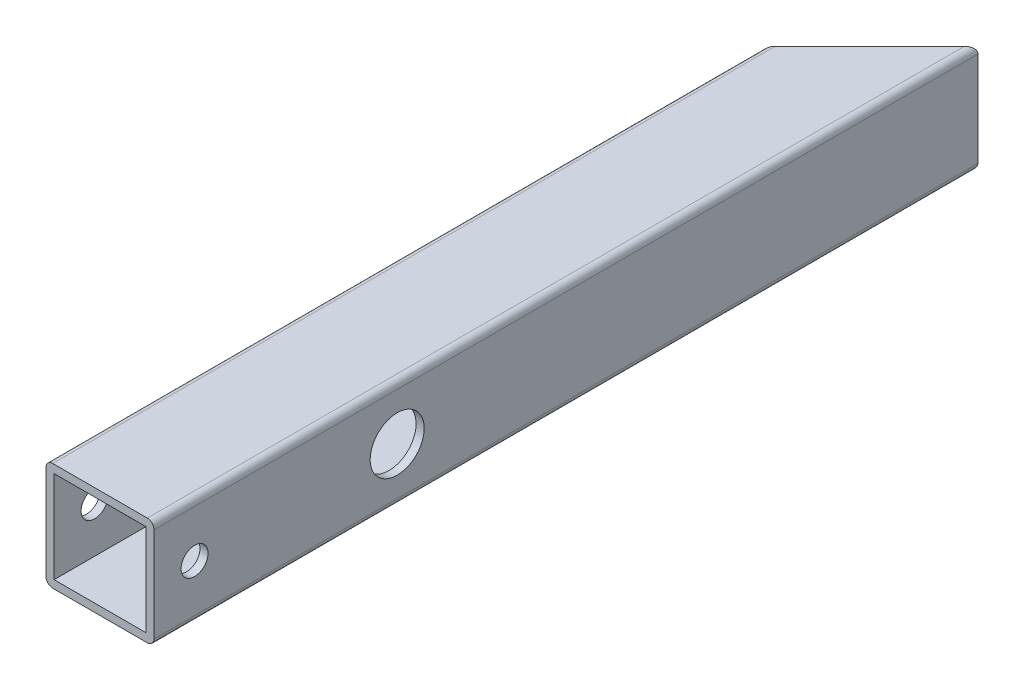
ISO-10303-21;
HEADER;
FILE_DESCRIPTION(('STEP AP214'),'2;1');
FILE_NAME('part.step','',(''),(''),'','','');
FILE_SCHEMA(('AUTOMOTIVE_DESIGN { 1 0 10303 214 1 1 1 1 }'));
ENDSEC;
DATA;
#1=APPLICATION_CONTEXT('core data for automotive mechanical design processes');
#2=APPLICATION_PROTOCOL_DEFINITION('international standard','automotive_design',2000,#1);
#3=PRODUCT_CONTEXT('',#1,'mechanical');
#4=PRODUCT('Part','Part','',(#3));
#5=PRODUCT_RELATED_PRODUCT_CATEGORY('part','',(#4));
#6=PRODUCT_DEFINITION_FORMATION('','',#4);
#7=PRODUCT_DEFINITION_CONTEXT('part definition',#1,'design');
#8=PRODUCT_DEFINITION('design','',#6,#7);
#9=PRODUCT_DEFINITION_SHAPE('','',#8);
#10=(LENGTH_UNIT() NAMED_UNIT(*) SI_UNIT(.MILLI.,.METRE.));
#11=(NAMED_UNIT(*) PLANE_ANGLE_UNIT() SI_UNIT($,.RADIAN.));
#12=(NAMED_UNIT(*) SI_UNIT($,.STERADIAN.) SOLID_ANGLE_UNIT());
#13=UNCERTAINTY_MEASURE_WITH_UNIT(LENGTH_MEASURE(1.E-05),#10,'distance_accuracy_value','');
#14=(GEOMETRIC_REPRESENTATION_CONTEXT(3) GLOBAL_UNCERTAINTY_ASSIGNED_CONTEXT((#13)) GLOBAL_UNIT_ASSIGNED_CONTEXT((#10,
#11,#12)) REPRESENTATION_CONTEXT('',''));
#15=CARTESIAN_POINT('',(0.,0.,0.));
#16=DIRECTION('',(0.,0.,1.));
#17=DIRECTION('',(1.,0.,0.));
#18=AXIS2_PLACEMENT_3D('',#15,#16,#17);
#19=CARTESIAN_POINT('',(1.11022302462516E-13,-80.0000000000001,610.));
#20=DIRECTION('',(0.,0.,1.));
#21=DIRECTION('',(0.999999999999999,0.,0.));
#22=AXIS2_PLACEMENT_3D('',#19,#20,#21);
#23=PLANE('',#22);
#24=DIRECTION('',(0.,-1.,0.));
#25=VECTOR('',#24,1.);
#26=CARTESIAN_POINT('',(0.,0.,610.));
#27=LINE('',#26,#25);
#28=CARTESIAN_POINT('',(0.,-4.99999999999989,610.));
#29=VERTEX_POINT('',#28);
#30=CARTESIAN_POINT('',(1.11022302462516E-13,-74.9999999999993,610.));
#31=VERTEX_POINT('',#30);
#32=EDGE_CURVE('E197',#29,#31,#27,.T.);
#33=ORIENTED_EDGE('',*,*,#32,.T.);
#34=CARTESIAN_POINT('',(5.00000000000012,-74.9999999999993,610.));
#35=DIRECTION('',(0.,0.,1.));
#36=DIRECTION('',(0.999999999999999,0.,0.));
#37=AXIS2_PLACEMENT_3D('',#34,#35,#36);
#38=CIRCLE('',#37,5.);
#39=CARTESIAN_POINT('',(5.00000000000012,-80.0000000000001,610.));
#40=VERTEX_POINT('',#39);
#41=EDGE_CURVE('E238',#31,#40,#38,.T.);
#42=ORIENTED_EDGE('',*,*,#41,.T.);
#43=DIRECTION('',(0.999999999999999,0.,0.));
#44=VECTOR('',#43,1.);
#45=CARTESIAN_POINT('',(1.11022302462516E-13,-80.0000000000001,610.));
#46=LINE('',#45,#44);
#47=CARTESIAN_POINT('',(74.9999999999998,-80.0000000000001,610.));
#48=VERTEX_POINT('',#47);
#49=EDGE_CURVE('E200',#40,#48,#46,.T.);
#50=ORIENTED_EDGE('',*,*,#49,.T.);
#51=CARTESIAN_POINT('',(74.9999999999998,-74.9999999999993,610.));
#52=DIRECTION('',(0.,0.,1.));
#53=DIRECTION('',(0.999999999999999,0.,0.));
#54=AXIS2_PLACEMENT_3D('',#51,#52,#53);
#55=CIRCLE('',#54,5.);
#56=CARTESIAN_POINT('',(79.9999999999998,-74.9999999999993,610.));
#57=VERTEX_POINT('',#56);
#58=EDGE_CURVE('E236',#48,#57,#55,.T.);
#59=ORIENTED_EDGE('',*,*,#58,.T.);
#60=DIRECTION('',(0.,1.,0.));
#61=VECTOR('',#60,1.);
#62=CARTESIAN_POINT('',(79.9999999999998,0.,610.));
#63=LINE('',#62,#61);
#64=CARTESIAN_POINT('',(79.9999999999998,-4.99999999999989,610.));
#65=VERTEX_POINT('',#64);
#66=EDGE_CURVE('E203',#57,#65,#63,.T.);
#67=ORIENTED_EDGE('',*,*,#66,.T.);
#68=CARTESIAN_POINT('',(75.,-4.99999999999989,610.));
#69=DIRECTION('',(0.,0.,1.));
#70=DIRECTION('',(0.999999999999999,0.,0.));
#71=AXIS2_PLACEMENT_3D('',#68,#69,#70);
#72=CIRCLE('',#71,5.);
#73=CARTESIAN_POINT('',(75.,0.,610.));
#74=VERTEX_POINT('',#73);
#75=EDGE_CURVE('E87',#65,#74,#72,.T.);
#76=ORIENTED_EDGE('',*,*,#75,.T.);
#77=DIRECTION('',(-0.999999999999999,0.,0.));
#78=VECTOR('',#77,1.);
#79=CARTESIAN_POINT('',(0.,0.,610.));
#80=LINE('',#79,#78);
#81=CARTESIAN_POINT('',(4.99999999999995,0.,610.));
#82=VERTEX_POINT('',#81);
#83=EDGE_CURVE('E167',#74,#82,#80,.T.);
#84=ORIENTED_EDGE('',*,*,#83,.T.);
#85=CARTESIAN_POINT('',(4.99999999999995,-4.99999999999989,610.));
#86=DIRECTION('',(0.,0.,1.));
#87=DIRECTION('',(0.999999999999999,0.,0.));
#88=AXIS2_PLACEMENT_3D('',#85,#86,#87);
#89=CIRCLE('',#88,5.);
#90=EDGE_CURVE('E234',#82,#29,#89,.T.);
#91=ORIENTED_EDGE('',*,*,#90,.T.);
#92=EDGE_LOOP('',(#33,#42,#50,#59,#67,#76,#84,#91));
#93=FACE_BOUND('',#92,.T.);
#94=DIRECTION('',(0.999999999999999,0.,0.));
#95=VECTOR('',#94,1.);
#96=CARTESIAN_POINT('',(1.11022302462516E-13,-73.9999999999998,610.));
#97=LINE('',#96,#95);
#98=CARTESIAN_POINT('',(6.00000000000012,-73.9999999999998,610.));
#99=VERTEX_POINT('',#98);
#100=CARTESIAN_POINT('',(73.9999999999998,-73.9999999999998,610.));
#101=VERTEX_POINT('',#100);
#102=EDGE_CURVE('E266',#99,#101,#97,.T.);
#103=ORIENTED_EDGE('',*,*,#102,.F.);
#104=DIRECTION('',(0.,-1.,0.));
#105=VECTOR('',#104,1.);
#106=CARTESIAN_POINT('',(5.99999999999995,0.,610.));
#107=LINE('',#106,#105);
#108=CARTESIAN_POINT('',(5.99999999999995,-5.99999999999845,609.999999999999));
#109=VERTEX_POINT('',#108);
#110=EDGE_CURVE('E177',#109,#99,#107,.T.);
#111=ORIENTED_EDGE('',*,*,#110,.F.);
#112=DIRECTION('',(-0.999999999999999,0.,0.));
#113=VECTOR('',#112,1.);
#114=CARTESIAN_POINT('',(0.,-5.99999999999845,609.999999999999));
#115=LINE('',#114,#113);
#116=CARTESIAN_POINT('',(73.9999999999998,-5.99999999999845,609.999999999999));
#117=VERTEX_POINT('',#116);
#118=EDGE_CURVE('E182',#117,#109,#115,.T.);
#119=ORIENTED_EDGE('',*,*,#118,.F.);
#120=DIRECTION('',(0.,1.,0.));
#121=VECTOR('',#120,1.);
#122=CARTESIAN_POINT('',(73.9999999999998,0.,610.));
#123=LINE('',#122,#121);
#124=EDGE_CURVE('E187',#101,#117,#123,.T.);
#125=ORIENTED_EDGE('',*,*,#124,.F.);
#126=EDGE_LOOP('',(#103,#111,#119,#125));
#127=FACE_BOUND('',#126,.T.);
#128=ADVANCED_FACE('F67',(#93,#127),#23,.T.);
#129=CARTESIAN_POINT('',(0.,0.,610.));
#130=DIRECTION('',(0.999999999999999,0.,0.));
#131=DIRECTION('',(0.,1.,0.));
#132=AXIS2_PLACEMENT_3D('',#129,#130,#131);
#133=PLANE('',#132);
#134=CARTESIAN_POINT('',(0.,-40.,430.));
#135=DIRECTION('',(0.999999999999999,0.,0.));
#136=DIRECTION('',(0.,1.,0.));
#137=AXIS2_PLACEMENT_3D('',#134,#135,#136);
#138=CIRCLE('',#137,20.);
#139=CARTESIAN_POINT('',(0.,-20.,430.));
#140=VERTEX_POINT('',#139);
#141=EDGE_CURVE('E215',#140,#140,#138,.T.);
#142=ORIENTED_EDGE('',*,*,#141,.T.);
#143=EDGE_LOOP('',(#142));
#144=FACE_BOUND('',#143,.T.);
#145=CARTESIAN_POINT('',(0.,-40.,580.));
#146=DIRECTION('',(0.999999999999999,0.,0.));
#147=DIRECTION('',(0.,1.,0.));
#148=AXIS2_PLACEMENT_3D('',#145,#146,#147);
#149=CIRCLE('',#148,9.99999999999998);
#150=CARTESIAN_POINT('',(0.,-30.,580.));
#151=VERTEX_POINT('',#150);
#152=EDGE_CURVE('E210',#151,#151,#149,.T.);
#153=ORIENTED_EDGE('',*,*,#152,.T.);
#154=EDGE_LOOP('',(#153));
#155=FACE_BOUND('',#154,.T.);
#156=DIRECTION('',(0.,1.,0.));
#157=VECTOR('',#156,1.);
#158=CARTESIAN_POINT('',(0.,-80.0000000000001,80.0000000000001));
#159=LINE('',#158,#157);
#160=CARTESIAN_POINT('',(0.,-75.0000000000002,80.0000000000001));
#161=VERTEX_POINT('',#160);
#162=CARTESIAN_POINT('',(1.11022302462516E-13,-4.99999999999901,79.9999999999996));
#163=VERTEX_POINT('',#162);
#164=EDGE_CURVE('E256',#161,#163,#159,.T.);
#165=ORIENTED_EDGE('',*,*,#164,.F.);
#166=DIRECTION('',(0.,0.,-1.));
#167=VECTOR('',#166,1.);
#168=CARTESIAN_POINT('',(1.11022302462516E-13,-74.9999999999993,610.));
#169=LINE('',#168,#167);
#170=EDGE_CURVE('E231',#161,#31,#169,.F.);
#171=ORIENTED_EDGE('',*,*,#170,.T.);
#172=ORIENTED_EDGE('',*,*,#32,.F.);
#173=DIRECTION('',(0.,0.,-1.));
#174=VECTOR('',#173,1.);
#175=CARTESIAN_POINT('',(0.,-4.99999999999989,610.));
#176=LINE('',#175,#174);
#177=EDGE_CURVE('E228',#29,#163,#176,.T.);
#178=ORIENTED_EDGE('',*,*,#177,.T.);
#179=EDGE_LOOP('',(#165,#171,#172,#178));
#180=FACE_BOUND('',#179,.T.);
#181=ADVANCED_FACE('F69',(#144,#155,#180),#133,.F.);
#182=CARTESIAN_POINT('',(1.11022302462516E-13,-80.0000000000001,610.));
#183=DIRECTION('',(0.,1.,0.));
#184=DIRECTION('',(0.,0.,1.));
#185=AXIS2_PLACEMENT_3D('',#182,#183,#184);
#186=PLANE('',#185);
#187=ORIENTED_EDGE('',*,*,#49,.F.);
#188=DIRECTION('',(0.,0.,-1.));
#189=VECTOR('',#188,1.);
#190=CARTESIAN_POINT('',(5.00000000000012,-80.0000000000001,610.));
#191=LINE('',#190,#189);
#192=CARTESIAN_POINT('',(4.99999999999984,-80.0000000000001,74.9999999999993));
#193=VERTEX_POINT('',#192);
#194=EDGE_CURVE('E217',#40,#193,#191,.T.);
#195=ORIENTED_EDGE('',*,*,#194,.T.);
#196=DIRECTION('',(0.707106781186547,0.,-0.707106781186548));
#197=VECTOR('',#196,1.);
#198=CARTESIAN_POINT('',(0.,-80.0000000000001,80.0000000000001));
#199=LINE('',#198,#197);
#200=CARTESIAN_POINT('',(74.9999999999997,-79.9999999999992,4.99999999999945));
#201=VERTEX_POINT('',#200);
#202=EDGE_CURVE('E253',#193,#201,#199,.T.);
#203=ORIENTED_EDGE('',*,*,#202,.T.);
#204=DIRECTION('',(0.,0.,-1.));
#205=VECTOR('',#204,1.);
#206=CARTESIAN_POINT('',(74.9999999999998,-80.0000000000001,610.));
#207=LINE('',#206,#205);
#208=EDGE_CURVE('E166',#201,#48,#207,.F.);
#209=ORIENTED_EDGE('',*,*,#208,.T.);
#210=EDGE_LOOP('',(#187,#195,#203,#209));
#211=FACE_BOUND('',#210,.T.);
#212=ADVANCED_FACE('F291',(#211),#186,.F.);
#213=CARTESIAN_POINT('',(79.9999999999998,0.,610.));
#214=DIRECTION('',(-0.999999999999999,0.,0.));
#215=DIRECTION('',(0.,-1.,0.));
#216=AXIS2_PLACEMENT_3D('',#213,#214,#215);
#217=PLANE('',#216);
#218=CARTESIAN_POINT('',(80.0000000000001,-40.,430.));
#219=DIRECTION('',(0.999999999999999,0.,0.));
#220=DIRECTION('',(0.,1.,0.));
#221=AXIS2_PLACEMENT_3D('',#218,#219,#220);
#222=CIRCLE('',#221,20.);
#223=CARTESIAN_POINT('',(80.0000000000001,-20.,430.));
#224=VERTEX_POINT('',#223);
#225=EDGE_CURVE('E454',#224,#224,#222,.T.);
#226=ORIENTED_EDGE('',*,*,#225,.F.);
#227=EDGE_LOOP('',(#226));
#228=FACE_BOUND('',#227,.T.);
#229=CARTESIAN_POINT('',(80.0000000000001,-40.,580.));
#230=DIRECTION('',(0.999999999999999,0.,0.));
#231=DIRECTION('',(0.,1.,0.));
#232=AXIS2_PLACEMENT_3D('',#229,#230,#231);
#233=CIRCLE('',#232,9.99999999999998);
#234=CARTESIAN_POINT('',(80.0000000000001,-30.,580.));
#235=VERTEX_POINT('',#234);
#236=EDGE_CURVE('E460',#235,#235,#233,.T.);
#237=ORIENTED_EDGE('',*,*,#236,.F.);
#238=EDGE_LOOP('',(#237));
#239=FACE_BOUND('',#238,.T.);
#240=ORIENTED_EDGE('',*,*,#66,.F.);
#241=DIRECTION('',(0.,0.,-1.));
#242=VECTOR('',#241,1.);
#243=CARTESIAN_POINT('',(79.9999999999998,-74.9999999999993,610.));
#244=LINE('',#243,#242);
#245=CARTESIAN_POINT('',(79.9999999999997,-75.0000000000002,0.));
#246=VERTEX_POINT('',#245);
#247=EDGE_CURVE('E242',#57,#246,#244,.T.);
#248=ORIENTED_EDGE('',*,*,#247,.T.);
#249=DIRECTION('',(0.,1.,0.));
#250=VECTOR('',#249,1.);
#251=CARTESIAN_POINT('',(79.9999999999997,0.,0.));
#252=LINE('',#251,#250);
#253=CARTESIAN_POINT('',(79.9999999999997,-4.99999999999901,-8.88178419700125E-13));
#254=VERTEX_POINT('',#253);
#255=EDGE_CURVE('E194',#246,#254,#252,.T.);
#256=ORIENTED_EDGE('',*,*,#255,.T.);
#257=DIRECTION('',(0.,0.,-1.));
#258=VECTOR('',#257,1.);
#259=CARTESIAN_POINT('',(79.9999999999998,-4.99999999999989,610.));
#260=LINE('',#259,#258);
#261=EDGE_CURVE('E240',#254,#65,#260,.F.);
#262=ORIENTED_EDGE('',*,*,#261,.T.);
#263=EDGE_LOOP('',(#240,#248,#256,#262));
#264=FACE_BOUND('',#263,.T.);
#265=ADVANCED_FACE('F296',(#228,#239,#264),#217,.F.);
#266=CARTESIAN_POINT('',(0.,0.,610.));
#267=DIRECTION('',(0.,-1.,0.));
#268=DIRECTION('',(0.,0.,-1.));
#269=AXIS2_PLACEMENT_3D('',#266,#267,#268);
#270=PLANE('',#269);
#271=DIRECTION('',(0.707106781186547,0.,-0.707106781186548));
#272=VECTOR('',#271,1.);
#273=CARTESIAN_POINT('',(1.11022302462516E-13,0.,80.0000000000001));
#274=LINE('',#273,#272);
#275=CARTESIAN_POINT('',(5.00000000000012,8.88178419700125E-13,74.9999999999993));
#276=VERTEX_POINT('',#275);
#277=CARTESIAN_POINT('',(74.9999999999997,0.,5.00000000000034));
#278=VERTEX_POINT('',#277);
#279=EDGE_CURVE('E248',#276,#278,#274,.T.);
#280=ORIENTED_EDGE('',*,*,#279,.F.);
#281=DIRECTION('',(0.,0.,-1.));
#282=VECTOR('',#281,1.);
#283=CARTESIAN_POINT('',(4.99999999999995,0.,610.));
#284=LINE('',#283,#282);
#285=EDGE_CURVE('E14',#276,#82,#284,.F.);
#286=ORIENTED_EDGE('',*,*,#285,.T.);
#287=ORIENTED_EDGE('',*,*,#83,.F.);
#288=DIRECTION('',(0.,0.,-1.));
#289=VECTOR('',#288,1.);
#290=CARTESIAN_POINT('',(75.,0.,610.));
#291=LINE('',#290,#289);
#292=EDGE_CURVE('E75',#74,#278,#291,.T.);
#293=ORIENTED_EDGE('',*,*,#292,.T.);
#294=EDGE_LOOP('',(#280,#286,#287,#293));
#295=FACE_BOUND('',#294,.T.);
#296=ADVANCED_FACE('F247',(#295),#270,.F.);
#297=CARTESIAN_POINT('',(5.99999999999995,0.,610.));
#298=DIRECTION('',(0.999999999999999,0.,0.));
#299=DIRECTION('',(0.,1.,0.));
#300=AXIS2_PLACEMENT_3D('',#297,#298,#299);
#301=PLANE('',#300);
#302=CARTESIAN_POINT('',(6.00000000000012,-40.,430.));
#303=DIRECTION('',(0.999999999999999,0.,0.));
#304=DIRECTION('',(0.,1.,0.));
#305=AXIS2_PLACEMENT_3D('',#302,#303,#304);
#306=CIRCLE('',#305,20.);
#307=CARTESIAN_POINT('',(6.00000000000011,-20.,430.));
#308=VERTEX_POINT('',#307);
#309=EDGE_CURVE('E214',#308,#308,#306,.T.);
#310=ORIENTED_EDGE('',*,*,#309,.F.);
#311=EDGE_LOOP('',(#310));
#312=FACE_BOUND('',#311,.T.);
#313=CARTESIAN_POINT('',(5.99999999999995,-40.,580.));
#314=DIRECTION('',(0.999999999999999,0.,0.));
#315=DIRECTION('',(0.,1.,0.));
#316=AXIS2_PLACEMENT_3D('',#313,#314,#315);
#317=CIRCLE('',#316,9.99999999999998);
#318=CARTESIAN_POINT('',(5.99999999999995,-30.,580.));
#319=VERTEX_POINT('',#318);
#320=EDGE_CURVE('E209',#319,#319,#317,.T.);
#321=ORIENTED_EDGE('',*,*,#320,.F.);
#322=EDGE_LOOP('',(#321));
#323=FACE_BOUND('',#322,.T.);
#324=DIRECTION('',(0.,-1.,0.));
#325=VECTOR('',#324,1.);
#326=CARTESIAN_POINT('',(6.00000000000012,0.,74.0000000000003));
#327=LINE('',#326,#325);
#328=CARTESIAN_POINT('',(6.00000000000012,-6.00000000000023,74.0000000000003));
#329=VERTEX_POINT('',#328);
#330=CARTESIAN_POINT('',(5.99999999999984,-73.9999999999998,73.9999999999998));
#331=VERTEX_POINT('',#330);
#332=EDGE_CURVE('E159',#329,#331,#327,.T.);
#333=ORIENTED_EDGE('',*,*,#332,.F.);
#334=DIRECTION('',(0.,0.,-1.));
#335=VECTOR('',#334,1.);
#336=CARTESIAN_POINT('',(5.99999999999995,-5.99999999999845,609.999999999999));
#337=LINE('',#336,#335);
#338=EDGE_CURVE('E173',#109,#329,#337,.T.);
#339=ORIENTED_EDGE('',*,*,#338,.F.);
#340=ORIENTED_EDGE('',*,*,#110,.T.);
#341=DIRECTION('',(0.,0.,-1.));
#342=VECTOR('',#341,1.);
#343=CARTESIAN_POINT('',(6.00000000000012,-73.9999999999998,610.));
#344=LINE('',#343,#342);
#345=EDGE_CURVE('E176',#99,#331,#344,.T.);
#346=ORIENTED_EDGE('',*,*,#345,.T.);
#347=EDGE_LOOP('',(#333,#339,#340,#346));
#348=FACE_BOUND('',#347,.T.);
#349=ADVANCED_FACE('F172',(#312,#323,#348),#301,.T.);
#350=CARTESIAN_POINT('',(1.11022302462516E-13,-73.9999999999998,610.));
#351=DIRECTION('',(0.,1.,0.));
#352=DIRECTION('',(0.,0.,1.));
#353=AXIS2_PLACEMENT_3D('',#350,#351,#352);
#354=PLANE('',#353);
#355=DIRECTION('',(0.707106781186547,0.,-0.707106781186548));
#356=VECTOR('',#355,1.);
#357=CARTESIAN_POINT('',(-265.,-73.9999999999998,345.));
#358=LINE('',#357,#356);
#359=CARTESIAN_POINT('',(73.9999999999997,-73.9999999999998,6.00000000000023));
#360=VERTEX_POINT('',#359);
#361=EDGE_CURVE('E178',#331,#360,#358,.T.);
#362=ORIENTED_EDGE('',*,*,#361,.F.);
#363=ORIENTED_EDGE('',*,*,#345,.F.);
#364=ORIENTED_EDGE('',*,*,#102,.T.);
#365=DIRECTION('',(0.,0.,-1.));
#366=VECTOR('',#365,1.);
#367=CARTESIAN_POINT('',(73.9999999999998,-73.9999999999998,610.));
#368=LINE('',#367,#366);
#369=EDGE_CURVE('E185',#101,#360,#368,.T.);
#370=ORIENTED_EDGE('',*,*,#369,.T.);
#371=EDGE_LOOP('',(#362,#363,#364,#370));
#372=FACE_BOUND('',#371,.T.);
#373=ADVANCED_FACE('F275',(#372),#354,.T.);
#374=CARTESIAN_POINT('',(73.9999999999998,0.,610.));
#375=DIRECTION('',(-0.999999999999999,0.,0.));
#376=DIRECTION('',(0.,-1.,0.));
#377=AXIS2_PLACEMENT_3D('',#374,#375,#376);
#378=PLANE('',#377);
#379=CARTESIAN_POINT('',(74.0000000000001,-40.,430.));
#380=DIRECTION('',(-0.999999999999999,0.,0.));
#381=DIRECTION('',(0.,-1.,0.));
#382=AXIS2_PLACEMENT_3D('',#379,#380,#381);
#383=CIRCLE('',#382,20.);
#384=CARTESIAN_POINT('',(74.0000000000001,-20.,430.));
#385=VERTEX_POINT('',#384);
#386=EDGE_CURVE('E211',#385,#385,#383,.T.);
#387=ORIENTED_EDGE('',*,*,#386,.F.);
#388=EDGE_LOOP('',(#387));
#389=FACE_BOUND('',#388,.T.);
#390=CARTESIAN_POINT('',(74.0000000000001,-40.,580.));
#391=DIRECTION('',(-0.999999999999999,0.,0.));
#392=DIRECTION('',(0.,-1.,0.));
#393=AXIS2_PLACEMENT_3D('',#390,#391,#392);
#394=CIRCLE('',#393,9.99999999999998);
#395=CARTESIAN_POINT('',(74.0000000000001,-30.,580.));
#396=VERTEX_POINT('',#395);
#397=EDGE_CURVE('E206',#396,#396,#394,.T.);
#398=ORIENTED_EDGE('',*,*,#397,.F.);
#399=EDGE_LOOP('',(#398));
#400=FACE_BOUND('',#399,.T.);
#401=DIRECTION('',(0.,1.,0.));
#402=VECTOR('',#401,1.);
#403=CARTESIAN_POINT('',(73.9999999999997,0.,5.99999999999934));
#404=LINE('',#403,#402);
#405=CARTESIAN_POINT('',(73.9999999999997,-5.99999999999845,5.99999999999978));
#406=VERTEX_POINT('',#405);
#407=EDGE_CURVE('E162',#360,#406,#404,.T.);
#408=ORIENTED_EDGE('',*,*,#407,.F.);
#409=ORIENTED_EDGE('',*,*,#369,.F.);
#410=ORIENTED_EDGE('',*,*,#124,.T.);
#411=DIRECTION('',(0.,0.,-1.));
#412=VECTOR('',#411,1.);
#413=CARTESIAN_POINT('',(73.9999999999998,-5.99999999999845,609.999999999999));
#414=LINE('',#413,#412);
#415=EDGE_CURVE('E183',#117,#406,#414,.T.);
#416=ORIENTED_EDGE('',*,*,#415,.T.);
#417=EDGE_LOOP('',(#408,#409,#410,#416));
#418=FACE_BOUND('',#417,.T.);
#419=ADVANCED_FACE('F271',(#389,#400,#418),#378,.T.);
#420=CARTESIAN_POINT('',(0.,-5.99999999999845,609.999999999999));
#421=DIRECTION('',(0.,-1.,0.));
#422=DIRECTION('',(0.,0.,-1.));
#423=AXIS2_PLACEMENT_3D('',#420,#421,#422);
#424=PLANE('',#423);
#425=DIRECTION('',(-0.707106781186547,0.,0.707106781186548));
#426=VECTOR('',#425,1.);
#427=CARTESIAN_POINT('',(-265.,-6.00000000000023,345.));
#428=LINE('',#427,#426);
#429=EDGE_CURVE('E155',#406,#329,#428,.T.);
#430=ORIENTED_EDGE('',*,*,#429,.F.);
#431=ORIENTED_EDGE('',*,*,#415,.F.);
#432=ORIENTED_EDGE('',*,*,#118,.T.);
#433=ORIENTED_EDGE('',*,*,#338,.T.);
#434=EDGE_LOOP('',(#430,#431,#432,#433));
#435=FACE_BOUND('',#434,.T.);
#436=ADVANCED_FACE('F180',(#435),#424,.T.);
#437=CARTESIAN_POINT('',(0.,-80.0000000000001,80.0000000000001));
#438=DIRECTION('',(0.707106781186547,0.,0.707106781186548));
#439=DIRECTION('',(0.707106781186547,0.,-0.707106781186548));
#440=AXIS2_PLACEMENT_3D('',#437,#438,#439);
#441=PLANE('',#440);
#442=ORIENTED_EDGE('',*,*,#332,.T.);
#443=ORIENTED_EDGE('',*,*,#361,.T.);
#444=ORIENTED_EDGE('',*,*,#407,.T.);
#445=ORIENTED_EDGE('',*,*,#429,.T.);
#446=EDGE_LOOP('',(#442,#443,#444,#445));
#447=FACE_BOUND('',#446,.T.);
#448=ORIENTED_EDGE('',*,*,#202,.F.);
#449=CARTESIAN_POINT('',(4.99999999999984,-74.9999999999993,74.9999999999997));
#450=DIRECTION('',(0.707106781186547,0.,0.707106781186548));
#451=DIRECTION('',(0.707106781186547,0.,-0.707106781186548));
#452=AXIS2_PLACEMENT_3D('',#449,#450,#451);
#453=ELLIPSE('',#452,7.07106781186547,5.);
#454=EDGE_CURVE('E226',#193,#161,#453,.F.);
#455=ORIENTED_EDGE('',*,*,#454,.T.);
#456=ORIENTED_EDGE('',*,*,#164,.T.);
#457=CARTESIAN_POINT('',(5.00000000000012,-4.99999999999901,74.9999999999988));
#458=DIRECTION('',(0.707106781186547,0.,0.707106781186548));
#459=DIRECTION('',(0.707106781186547,0.,-0.707106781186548));
#460=AXIS2_PLACEMENT_3D('',#457,#458,#459);
#461=ELLIPSE('',#460,7.07106781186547,5.);
#462=EDGE_CURVE('E222',#163,#276,#461,.F.);
#463=ORIENTED_EDGE('',*,*,#462,.T.);
#464=ORIENTED_EDGE('',*,*,#279,.T.);
#465=CARTESIAN_POINT('',(74.9999999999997,-4.99999999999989,4.99999999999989));
#466=DIRECTION('',(0.707106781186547,0.,0.707106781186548));
#467=DIRECTION('',(0.707106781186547,0.,-0.707106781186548));
#468=AXIS2_PLACEMENT_3D('',#465,#466,#467);
#469=ELLIPSE('',#468,7.07106781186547,5.);
#470=EDGE_CURVE('E220',#278,#254,#469,.F.);
#471=ORIENTED_EDGE('',*,*,#470,.T.);
#472=ORIENTED_EDGE('',*,*,#255,.F.);
#473=CARTESIAN_POINT('',(74.9999999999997,-74.9999999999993,4.99999999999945));
#474=DIRECTION('',(0.707106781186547,0.,0.707106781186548));
#475=DIRECTION('',(0.707106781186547,0.,-0.707106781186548));
#476=AXIS2_PLACEMENT_3D('',#473,#474,#475);
#477=ELLIPSE('',#476,7.07106781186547,5.);
#478=EDGE_CURVE('E224',#246,#201,#477,.F.);
#479=ORIENTED_EDGE('',*,*,#478,.T.);
#480=EDGE_LOOP('',(#448,#455,#456,#463,#464,#471,#472,#479));
#481=FACE_BOUND('',#480,.T.);
#482=ADVANCED_FACE('F157',(#447,#481),#441,.F.);
#483=CARTESIAN_POINT('',(0.,-40.,580.));
#484=DIRECTION('',(0.999999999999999,0.,0.));
#485=DIRECTION('',(0.,1.,0.));
#486=AXIS2_PLACEMENT_3D('',#483,#484,#485);
#487=CYLINDRICAL_SURFACE('',#486,9.99999999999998);
#488=CARTESIAN_POINT('',(74.0000000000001,-30.,580.));
#489=CARTESIAN_POINT('',(74.0625000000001,-30.,580.));
#490=CARTESIAN_POINT('',(74.1250000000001,-30.,580.));
#491=CARTESIAN_POINT('',(74.2500000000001,-30.,580.));
#492=CARTESIAN_POINT('',(74.3125000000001,-30.,580.));
#493=CARTESIAN_POINT('',(74.4375000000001,-30.,580.));
#494=CARTESIAN_POINT('',(74.5000000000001,-30.,580.));
#495=CARTESIAN_POINT('',(74.6250000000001,-30.,580.));
#496=CARTESIAN_POINT('',(74.6875000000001,-30.,580.));
#497=CARTESIAN_POINT('',(74.8125000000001,-30.,580.));
#498=CARTESIAN_POINT('',(74.8750000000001,-30.,580.));
#499=CARTESIAN_POINT('',(75.0000000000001,-30.,580.));
#500=CARTESIAN_POINT('',(75.0625000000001,-30.,580.));
#501=CARTESIAN_POINT('',(75.1875000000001,-30.,580.));
#502=CARTESIAN_POINT('',(75.2500000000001,-30.,580.));
#503=CARTESIAN_POINT('',(75.3750000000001,-30.,580.));
#504=CARTESIAN_POINT('',(75.4375000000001,-30.,580.));
#505=CARTESIAN_POINT('',(75.5625000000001,-30.,580.));
#506=CARTESIAN_POINT('',(75.6250000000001,-30.,580.));
#507=CARTESIAN_POINT('',(75.7500000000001,-30.,580.));
#508=CARTESIAN_POINT('',(75.8125000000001,-30.,580.));
#509=CARTESIAN_POINT('',(75.9375000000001,-30.,580.));
#510=CARTESIAN_POINT('',(76.0000000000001,-30.,580.));
#511=CARTESIAN_POINT('',(76.1250000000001,-30.,580.));
#512=CARTESIAN_POINT('',(76.1875000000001,-30.,580.));
#513=CARTESIAN_POINT('',(76.3125000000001,-30.,580.));
#514=CARTESIAN_POINT('',(76.3750000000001,-30.,580.));
#515=CARTESIAN_POINT('',(76.5000000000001,-30.,580.));
#516=CARTESIAN_POINT('',(76.5625,-30.,580.));
#517=CARTESIAN_POINT('',(76.6875,-30.,580.));
#518=CARTESIAN_POINT('',(76.7500000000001,-30.,580.));
#519=CARTESIAN_POINT('',(76.8750000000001,-30.,580.));
#520=CARTESIAN_POINT('',(76.9375,-30.,580.));
#521=CARTESIAN_POINT('',(77.0625000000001,-30.,580.));
#522=CARTESIAN_POINT('',(77.1250000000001,-30.,580.));
#523=CARTESIAN_POINT('',(77.2500000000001,-30.,580.));
#524=CARTESIAN_POINT('',(77.3125000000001,-30.,580.));
#525=CARTESIAN_POINT('',(77.4375000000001,-30.,580.));
#526=CARTESIAN_POINT('',(77.5000000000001,-30.,580.));
#527=CARTESIAN_POINT('',(77.6250000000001,-30.,580.));
#528=CARTESIAN_POINT('',(77.6875000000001,-30.,580.));
#529=CARTESIAN_POINT('',(77.8125000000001,-30.,580.));
#530=CARTESIAN_POINT('',(77.8750000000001,-30.,580.));
#531=CARTESIAN_POINT('',(78.0000000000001,-30.,580.));
#532=CARTESIAN_POINT('',(78.0625000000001,-30.,580.));
#533=CARTESIAN_POINT('',(78.1875000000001,-30.,580.));
#534=CARTESIAN_POINT('',(78.2500000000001,-30.,580.));
#535=CARTESIAN_POINT('',(78.3750000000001,-30.,580.));
#536=CARTESIAN_POINT('',(78.4375000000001,-30.,580.));
#537=CARTESIAN_POINT('',(78.5625000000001,-30.,580.));
#538=CARTESIAN_POINT('',(78.6250000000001,-30.,580.));
#539=CARTESIAN_POINT('',(78.7500000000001,-30.,580.));
#540=CARTESIAN_POINT('',(78.8125000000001,-30.,580.));
#541=CARTESIAN_POINT('',(78.9375000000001,-30.,580.));
#542=CARTESIAN_POINT('',(79.0000000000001,-30.,580.));
#543=CARTESIAN_POINT('',(79.1250000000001,-30.,580.));
#544=CARTESIAN_POINT('',(79.1875000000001,-30.,580.));
#545=CARTESIAN_POINT('',(79.3125000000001,-30.,580.));
#546=CARTESIAN_POINT('',(79.3750000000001,-30.,580.));
#547=CARTESIAN_POINT('',(79.5000000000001,-30.,580.));
#548=CARTESIAN_POINT('',(79.5625000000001,-30.,580.));
#549=CARTESIAN_POINT('',(79.6875000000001,-30.,580.));
#550=CARTESIAN_POINT('',(79.7500000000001,-30.,580.));
#551=CARTESIAN_POINT('',(79.8750000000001,-30.,580.));
#552=CARTESIAN_POINT('',(79.9375000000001,-30.,580.));
#553=CARTESIAN_POINT('',(80.0000000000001,-30.,580.));
#554=B_SPLINE_CURVE_WITH_KNOTS('',3,(#488,#489,#490,#491,#492,#493,#494,#495,#496,#497,#498,
#499,#500,#501,#502,#503,#504,#505,#506,#507,#508,#509,#510,#511,#512,#513,#514,#515,#516,#517,
#518,#519,#520,#521,#522,#523,#524,#525,#526,#527,#528,#529,#530,#531,#532,#533,#534,#535,#536,
#537,#538,#539,#540,#541,#542,#543,#544,#545,#546,#547,#548,#549,#550,#551,#552,#553),
.UNSPECIFIED.,.F.,.F.,(4,2,2,2,2,2,2,2,2,2,2,2,2,2,2,2,2,2,2,2,2,2,2,2,2,2,2,2,2,2,2,2,4),(0.,
0.187500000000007,0.375,0.562500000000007,0.750000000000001,0.937500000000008,1.125,
1.31250000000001,1.5,1.68750000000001,1.87500000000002,2.06250000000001,2.25000000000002,2.4375,
2.625,2.8125,3.,3.18750000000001,3.375,3.56250000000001,3.75,3.93750000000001,4.125,
4.31250000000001,4.50000000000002,4.68750000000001,4.87500000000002,5.06250000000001,
5.25000000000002,5.43750000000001,5.62500000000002,5.81250000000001,6.00000000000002),.UNSPECIFIED.);
#555=EDGE_CURVE('BSEAM338',#396,#235,#554,.T.);
#556=ORIENTED_EDGE('',*,*,#397,.T.);
#557=ORIENTED_EDGE('',*,*,#236,.T.);
#558=ORIENTED_EDGE('',*,*,#555,.T.);
#559=ORIENTED_EDGE('',*,*,#555,.F.);
#560=EDGE_LOOP('',(#556,#558,#557,#559));
#561=FACE_BOUND('',#560,.T.);
#562=ADVANCED_FACE('F338',(#561),#487,.F.);
#563=CARTESIAN_POINT('',(5.99999999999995,-30.,580.));
#564=CARTESIAN_POINT('',(5.93749999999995,-30.,580.));
#565=CARTESIAN_POINT('',(5.87499999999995,-30.,580.));
#566=CARTESIAN_POINT('',(5.74999999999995,-30.,580.));
#567=CARTESIAN_POINT('',(5.68749999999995,-30.,580.));
#568=CARTESIAN_POINT('',(5.56249999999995,-30.,580.));
#569=CARTESIAN_POINT('',(5.49999999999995,-30.,580.));
#570=CARTESIAN_POINT('',(5.37499999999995,-30.,580.));
#571=CARTESIAN_POINT('',(5.31249999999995,-30.,580.));
#572=CARTESIAN_POINT('',(5.18749999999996,-30.,580.));
#573=CARTESIAN_POINT('',(5.12499999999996,-30.,580.));
#574=CARTESIAN_POINT('',(4.99999999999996,-30.,580.));
#575=CARTESIAN_POINT('',(4.93749999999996,-30.,580.));
#576=CARTESIAN_POINT('',(4.81249999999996,-30.,580.));
#577=CARTESIAN_POINT('',(4.74999999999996,-30.,580.));
#578=CARTESIAN_POINT('',(4.62499999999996,-30.,580.));
#579=CARTESIAN_POINT('',(4.56249999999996,-30.,580.));
#580=CARTESIAN_POINT('',(4.43749999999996,-30.,580.));
#581=CARTESIAN_POINT('',(4.37499999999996,-30.,580.));
#582=CARTESIAN_POINT('',(4.24999999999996,-30.,580.));
#583=CARTESIAN_POINT('',(4.18749999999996,-30.,580.));
#584=CARTESIAN_POINT('',(4.06249999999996,-30.,580.));
#585=CARTESIAN_POINT('',(3.99999999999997,-30.,580.));
#586=CARTESIAN_POINT('',(3.87499999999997,-30.,580.));
#587=CARTESIAN_POINT('',(3.81249999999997,-30.,580.));
#588=CARTESIAN_POINT('',(3.68749999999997,-30.,580.));
#589=CARTESIAN_POINT('',(3.62499999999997,-30.,580.));
#590=CARTESIAN_POINT('',(3.49999999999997,-30.,580.));
#591=CARTESIAN_POINT('',(3.43749999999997,-30.,580.));
#592=CARTESIAN_POINT('',(3.31249999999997,-30.,580.));
#593=CARTESIAN_POINT('',(3.24999999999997,-30.,580.));
#594=CARTESIAN_POINT('',(3.12499999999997,-30.,580.));
#595=CARTESIAN_POINT('',(3.06249999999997,-30.,580.));
#596=CARTESIAN_POINT('',(2.93749999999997,-30.,580.));
#597=CARTESIAN_POINT('',(2.87499999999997,-30.,580.));
#598=CARTESIAN_POINT('',(2.74999999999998,-30.,580.));
#599=CARTESIAN_POINT('',(2.68749999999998,-30.,580.));
#600=CARTESIAN_POINT('',(2.56249999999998,-30.,580.));
#601=CARTESIAN_POINT('',(2.49999999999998,-30.,580.));
#602=CARTESIAN_POINT('',(2.37499999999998,-30.,580.));
#603=CARTESIAN_POINT('',(2.31249999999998,-30.,580.));
#604=CARTESIAN_POINT('',(2.18749999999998,-30.,580.));
#605=CARTESIAN_POINT('',(2.12499999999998,-30.,580.));
#606=CARTESIAN_POINT('',(1.99999999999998,-30.,580.));
#607=CARTESIAN_POINT('',(1.93749999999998,-30.,580.));
#608=CARTESIAN_POINT('',(1.81249999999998,-30.,580.));
#609=CARTESIAN_POINT('',(1.74999999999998,-30.,580.));
#610=CARTESIAN_POINT('',(1.62499999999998,-30.,580.));
#611=CARTESIAN_POINT('',(1.56249999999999,-30.,580.));
#612=CARTESIAN_POINT('',(1.43749999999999,-30.,580.));
#613=CARTESIAN_POINT('',(1.37499999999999,-30.,580.));
#614=CARTESIAN_POINT('',(1.24999999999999,-30.,580.));
#615=CARTESIAN_POINT('',(1.18749999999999,-30.,580.));
#616=CARTESIAN_POINT('',(1.06249999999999,-30.,580.));
#617=CARTESIAN_POINT('',(0.99999999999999,-30.,580.));
#618=CARTESIAN_POINT('',(0.874999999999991,-30.,580.));
#619=CARTESIAN_POINT('',(0.812499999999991,-30.,580.));
#620=CARTESIAN_POINT('',(0.687499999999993,-30.,580.));
#621=CARTESIAN_POINT('',(0.624999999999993,-30.,580.));
#622=CARTESIAN_POINT('',(0.499999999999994,-30.,580.));
#623=CARTESIAN_POINT('',(0.437499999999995,-30.,580.));
#624=CARTESIAN_POINT('',(0.312499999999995,-30.,580.));
#625=CARTESIAN_POINT('',(0.249999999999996,-30.,580.));
#626=CARTESIAN_POINT('',(0.124999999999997,-30.,580.));
#627=CARTESIAN_POINT('',(0.0624999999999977,-30.,580.));
#628=CARTESIAN_POINT('',(0.,-30.,580.));
#629=B_SPLINE_CURVE_WITH_KNOTS('',3,(#563,#564,#565,#566,#567,#568,#569,#570,#571,#572,#573,
#574,#575,#576,#577,#578,#579,#580,#581,#582,#583,#584,#585,#586,#587,#588,#589,#590,#591,#592,
#593,#594,#595,#596,#597,#598,#599,#600,#601,#602,#603,#604,#605,#606,#607,#608,#609,#610,#611,
#612,#613,#614,#615,#616,#617,#618,#619,#620,#621,#622,#623,#624,#625,#626,#627,#628),
.UNSPECIFIED.,.F.,.F.,(4,2,2,2,2,2,2,2,2,2,2,2,2,2,2,2,2,2,2,2,2,2,2,2,2,2,2,2,2,2,2,2,4),(0.,
0.187499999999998,0.374999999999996,0.562499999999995,0.749999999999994,0.937499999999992,
1.12499999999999,1.31249999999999,1.49999999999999,1.68749999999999,1.87499999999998,
2.06249999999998,2.24999999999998,2.43749999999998,2.62499999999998,2.81249999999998,
2.99999999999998,3.18749999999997,3.37499999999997,3.56249999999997,3.74999999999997,
3.93749999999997,4.12499999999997,4.31249999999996,4.49999999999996,4.68749999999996,
4.87499999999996,5.06249999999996,5.24999999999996,5.43749999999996,5.62499999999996,
5.81249999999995,5.99999999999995),.UNSPECIFIED.);
#630=EDGE_CURVE('BSEAM336',#319,#151,#629,.T.);
#631=ORIENTED_EDGE('',*,*,#320,.T.);
#632=ORIENTED_EDGE('',*,*,#152,.F.);
#633=ORIENTED_EDGE('',*,*,#630,.T.);
#634=ORIENTED_EDGE('',*,*,#630,.F.);
#635=EDGE_LOOP('',(#631,#633,#632,#634));
#636=FACE_BOUND('',#635,.T.);
#637=ADVANCED_FACE('F336',(#636),#487,.F.);
#638=CARTESIAN_POINT('',(0.,-40.,430.));
#639=DIRECTION('',(0.999999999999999,0.,0.));
#640=DIRECTION('',(0.,1.,0.));
#641=AXIS2_PLACEMENT_3D('',#638,#639,#640);
#642=CYLINDRICAL_SURFACE('',#641,20.);
#643=CARTESIAN_POINT('',(74.0000000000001,-20.,430.));
#644=CARTESIAN_POINT('',(74.0625000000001,-20.,430.));
#645=CARTESIAN_POINT('',(74.1250000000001,-20.,430.));
#646=CARTESIAN_POINT('',(74.2500000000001,-20.,430.));
#647=CARTESIAN_POINT('',(74.3125000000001,-20.,430.));
#648=CARTESIAN_POINT('',(74.4375000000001,-20.,430.));
#649=CARTESIAN_POINT('',(74.5000000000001,-20.,430.));
#650=CARTESIAN_POINT('',(74.6250000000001,-20.,430.));
#651=CARTESIAN_POINT('',(74.6875000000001,-20.,430.));
#652=CARTESIAN_POINT('',(74.8125000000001,-20.,430.));
#653=CARTESIAN_POINT('',(74.8750000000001,-20.,430.));
#654=CARTESIAN_POINT('',(75.0000000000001,-20.,430.));
#655=CARTESIAN_POINT('',(75.0625000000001,-20.,430.));
#656=CARTESIAN_POINT('',(75.1875000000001,-20.,430.));
#657=CARTESIAN_POINT('',(75.2500000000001,-20.,430.));
#658=CARTESIAN_POINT('',(75.3750000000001,-20.,430.));
#659=CARTESIAN_POINT('',(75.4375000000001,-20.,430.));
#660=CARTESIAN_POINT('',(75.5625000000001,-20.,430.));
#661=CARTESIAN_POINT('',(75.6250000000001,-20.,430.));
#662=CARTESIAN_POINT('',(75.7500000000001,-20.,430.));
#663=CARTESIAN_POINT('',(75.8125000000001,-20.,430.));
#664=CARTESIAN_POINT('',(75.9375000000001,-20.,430.));
#665=CARTESIAN_POINT('',(76.0000000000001,-20.,430.));
#666=CARTESIAN_POINT('',(76.1250000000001,-20.,430.));
#667=CARTESIAN_POINT('',(76.1875000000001,-20.,430.));
#668=CARTESIAN_POINT('',(76.3125000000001,-20.,430.));
#669=CARTESIAN_POINT('',(76.3750000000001,-20.,430.));
#670=CARTESIAN_POINT('',(76.5000000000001,-20.,430.));
#671=CARTESIAN_POINT('',(76.5625,-20.,430.));
#672=CARTESIAN_POINT('',(76.6875,-20.,430.));
#673=CARTESIAN_POINT('',(76.7500000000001,-20.,430.));
#674=CARTESIAN_POINT('',(76.8750000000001,-20.,430.));
#675=CARTESIAN_POINT('',(76.9375,-20.,430.));
#676=CARTESIAN_POINT('',(77.0625000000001,-20.,430.));
#677=CARTESIAN_POINT('',(77.1250000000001,-20.,430.));
#678=CARTESIAN_POINT('',(77.2500000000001,-20.,430.));
#679=CARTESIAN_POINT('',(77.3125000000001,-20.,430.));
#680=CARTESIAN_POINT('',(77.4375000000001,-20.,430.));
#681=CARTESIAN_POINT('',(77.5000000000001,-20.,430.));
#682=CARTESIAN_POINT('',(77.6250000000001,-20.,430.));
#683=CARTESIAN_POINT('',(77.6875000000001,-20.,430.));
#684=CARTESIAN_POINT('',(77.8125000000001,-20.,430.));
#685=CARTESIAN_POINT('',(77.8750000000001,-20.,430.));
#686=CARTESIAN_POINT('',(78.0000000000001,-20.,430.));
#687=CARTESIAN_POINT('',(78.0625000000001,-20.,430.));
#688=CARTESIAN_POINT('',(78.1875000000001,-20.,430.));
#689=CARTESIAN_POINT('',(78.2500000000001,-20.,430.));
#690=CARTESIAN_POINT('',(78.3750000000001,-20.,430.));
#691=CARTESIAN_POINT('',(78.4375000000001,-20.,430.));
#692=CARTESIAN_POINT('',(78.5625000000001,-20.,430.));
#693=CARTESIAN_POINT('',(78.6250000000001,-20.,430.));
#694=CARTESIAN_POINT('',(78.7500000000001,-20.,430.));
#695=CARTESIAN_POINT('',(78.8125000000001,-20.,430.));
#696=CARTESIAN_POINT('',(78.9375000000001,-20.,430.));
#697=CARTESIAN_POINT('',(79.0000000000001,-20.,430.));
#698=CARTESIAN_POINT('',(79.1250000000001,-20.,430.));
#699=CARTESIAN_POINT('',(79.1875000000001,-20.,430.));
#700=CARTESIAN_POINT('',(79.3125000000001,-20.,430.));
#701=CARTESIAN_POINT('',(79.3750000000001,-20.,430.));
#702=CARTESIAN_POINT('',(79.5000000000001,-20.,430.));
#703=CARTESIAN_POINT('',(79.5625000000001,-20.,430.));
#704=CARTESIAN_POINT('',(79.6875000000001,-20.,430.));
#705=CARTESIAN_POINT('',(79.7500000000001,-20.,430.));
#706=CARTESIAN_POINT('',(79.8750000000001,-20.,430.));
#707=CARTESIAN_POINT('',(79.9375000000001,-20.,430.));
#708=CARTESIAN_POINT('',(80.0000000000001,-20.,430.));
#709=B_SPLINE_CURVE_WITH_KNOTS('',3,(#643,#644,#645,#646,#647,#648,#649,#650,#651,#652,#653,
#654,#655,#656,#657,#658,#659,#660,#661,#662,#663,#664,#665,#666,#667,#668,#669,#670,#671,#672,
#673,#674,#675,#676,#677,#678,#679,#680,#681,#682,#683,#684,#685,#686,#687,#688,#689,#690,#691,
#692,#693,#694,#695,#696,#697,#698,#699,#700,#701,#702,#703,#704,#705,#706,#707,#708),
.UNSPECIFIED.,.F.,.F.,(4,2,2,2,2,2,2,2,2,2,2,2,2,2,2,2,2,2,2,2,2,2,2,2,2,2,2,2,2,2,2,2,4),(0.,
0.187500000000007,0.375,0.562500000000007,0.750000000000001,0.937500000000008,1.125,
1.31250000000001,1.5,1.68750000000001,1.87500000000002,2.06250000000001,2.25000000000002,2.4375,
2.625,2.8125,3.,3.18750000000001,3.375,3.56250000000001,3.75,3.93750000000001,4.125,
4.31250000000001,4.50000000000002,4.68750000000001,4.87500000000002,5.06250000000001,
5.25000000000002,5.43750000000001,5.62500000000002,5.81250000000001,6.00000000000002),.UNSPECIFIED.);
#710=EDGE_CURVE('BSEAM333',#385,#224,#709,.T.);
#711=ORIENTED_EDGE('',*,*,#386,.T.);
#712=ORIENTED_EDGE('',*,*,#225,.T.);
#713=ORIENTED_EDGE('',*,*,#710,.T.);
#714=ORIENTED_EDGE('',*,*,#710,.F.);
#715=EDGE_LOOP('',(#711,#713,#712,#714));
#716=FACE_BOUND('',#715,.T.);
#717=ADVANCED_FACE('F333',(#716),#642,.F.);
#718=CARTESIAN_POINT('',(6.00000000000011,-20.,430.));
#719=CARTESIAN_POINT('',(5.93750000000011,-20.,430.));
#720=CARTESIAN_POINT('',(5.87500000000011,-20.,430.));
#721=CARTESIAN_POINT('',(5.75000000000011,-20.,430.));
#722=CARTESIAN_POINT('',(5.68750000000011,-20.,430.));
#723=CARTESIAN_POINT('',(5.5625000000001,-20.,430.));
#724=CARTESIAN_POINT('',(5.5000000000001,-20.,430.));
#725=CARTESIAN_POINT('',(5.3750000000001,-20.,430.));
#726=CARTESIAN_POINT('',(5.31250000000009,-20.,430.));
#727=CARTESIAN_POINT('',(5.18750000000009,-20.,430.));
#728=CARTESIAN_POINT('',(5.12500000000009,-20.,430.));
#729=CARTESIAN_POINT('',(5.00000000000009,-20.,430.));
#730=CARTESIAN_POINT('',(4.93750000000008,-20.,430.));
#731=CARTESIAN_POINT('',(4.81250000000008,-20.,430.));
#732=CARTESIAN_POINT('',(4.75000000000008,-20.,430.));
#733=CARTESIAN_POINT('',(4.62500000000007,-20.,430.));
#734=CARTESIAN_POINT('',(4.56250000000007,-20.,430.));
#735=CARTESIAN_POINT('',(4.43750000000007,-20.,430.));
#736=CARTESIAN_POINT('',(4.37500000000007,-20.,430.));
#737=CARTESIAN_POINT('',(4.25000000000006,-20.,430.));
#738=CARTESIAN_POINT('',(4.18750000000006,-20.,430.));
#739=CARTESIAN_POINT('',(4.06250000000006,-20.,430.));
#740=CARTESIAN_POINT('',(4.00000000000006,-20.,430.));
#741=CARTESIAN_POINT('',(3.87500000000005,-20.,430.));
#742=CARTESIAN_POINT('',(3.81250000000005,-20.,430.));
#743=CARTESIAN_POINT('',(3.68750000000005,-20.,430.));
#744=CARTESIAN_POINT('',(3.62500000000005,-20.,430.));
#745=CARTESIAN_POINT('',(3.50000000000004,-20.,430.));
#746=CARTESIAN_POINT('',(3.43750000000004,-20.,430.));
#747=CARTESIAN_POINT('',(3.31250000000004,-20.,430.));
#748=CARTESIAN_POINT('',(3.25000000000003,-20.,430.));
#749=CARTESIAN_POINT('',(3.12500000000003,-20.,430.));
#750=CARTESIAN_POINT('',(3.06250000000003,-20.,430.));
#751=CARTESIAN_POINT('',(2.93750000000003,-20.,430.));
#752=CARTESIAN_POINT('',(2.87500000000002,-20.,430.));
#753=CARTESIAN_POINT('',(2.75000000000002,-20.,430.));
#754=CARTESIAN_POINT('',(2.68750000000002,-20.,430.));
#755=CARTESIAN_POINT('',(2.56250000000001,-20.,430.));
#756=CARTESIAN_POINT('',(2.50000000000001,-20.,430.));
#757=CARTESIAN_POINT('',(2.37500000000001,-20.,430.));
#758=CARTESIAN_POINT('',(2.31250000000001,-20.,430.));
#759=CARTESIAN_POINT('',(2.1875,-20.,430.));
#760=CARTESIAN_POINT('',(2.125,-20.,430.));
#761=CARTESIAN_POINT('',(2.,-20.,430.));
#762=CARTESIAN_POINT('',(1.9375,-20.,430.));
#763=CARTESIAN_POINT('',(1.81249999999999,-20.,430.));
#764=CARTESIAN_POINT('',(1.74999999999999,-20.,430.));
#765=CARTESIAN_POINT('',(1.62499999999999,-20.,430.));
#766=CARTESIAN_POINT('',(1.56249999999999,-20.,430.));
#767=CARTESIAN_POINT('',(1.43749999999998,-20.,430.));
#768=CARTESIAN_POINT('',(1.37499999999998,-20.,430.));
#769=CARTESIAN_POINT('',(1.24999999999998,-20.,430.));
#770=CARTESIAN_POINT('',(1.18749999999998,-20.,430.));
#771=CARTESIAN_POINT('',(1.06249999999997,-20.,430.));
#772=CARTESIAN_POINT('',(0.99999999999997,-20.,430.));
#773=CARTESIAN_POINT('',(0.874999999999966,-20.,430.));
#774=CARTESIAN_POINT('',(0.812499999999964,-20.,430.));
#775=CARTESIAN_POINT('',(0.687499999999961,-20.,430.));
#776=CARTESIAN_POINT('',(0.624999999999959,-20.,430.));
#777=CARTESIAN_POINT('',(0.499999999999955,-20.,430.));
#778=CARTESIAN_POINT('',(0.437499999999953,-20.,430.));
#779=CARTESIAN_POINT('',(0.31249999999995,-20.,430.));
#780=CARTESIAN_POINT('',(0.249999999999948,-20.,430.));
#781=CARTESIAN_POINT('',(0.124999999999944,-20.,430.));
#782=CARTESIAN_POINT('',(0.0624999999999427,-20.,430.));
#783=CARTESIAN_POINT('',(0.,-20.,430.));
#784=B_SPLINE_CURVE_WITH_KNOTS('',3,(#718,#719,#720,#721,#722,#723,#724,#725,#726,#727,#728,
#729,#730,#731,#732,#733,#734,#735,#736,#737,#738,#739,#740,#741,#742,#743,#744,#745,#746,#747,
#748,#749,#750,#751,#752,#753,#754,#755,#756,#757,#758,#759,#760,#761,#762,#763,#764,#765,#766,
#767,#768,#769,#770,#771,#772,#773,#774,#775,#776,#777,#778,#779,#780,#781,#782,#783),
.UNSPECIFIED.,.F.,.F.,(4,2,2,2,2,2,2,2,2,2,2,2,2,2,2,2,2,2,2,2,2,2,2,2,2,2,2,2,2,2,2,2,4),(0.,
0.187500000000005,0.37500000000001,0.562500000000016,0.750000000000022,0.937500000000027,
1.12500000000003,1.31250000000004,1.50000000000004,1.68750000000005,1.87500000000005,
2.06250000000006,2.25000000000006,2.43750000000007,2.62500000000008,2.81250000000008,
3.00000000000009,3.18750000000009,3.3750000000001,3.5625000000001,3.75000000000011,
3.93750000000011,4.12500000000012,4.31250000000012,4.50000000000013,4.68750000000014,
4.87500000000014,5.06250000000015,5.25000000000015,5.43750000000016,5.62500000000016,
5.81250000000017,6.00000000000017),.UNSPECIFIED.);
#785=EDGE_CURVE('BSEAM332',#308,#140,#784,.T.);
#786=ORIENTED_EDGE('',*,*,#309,.T.);
#787=ORIENTED_EDGE('',*,*,#141,.F.);
#788=ORIENTED_EDGE('',*,*,#785,.T.);
#789=ORIENTED_EDGE('',*,*,#785,.F.);
#790=EDGE_LOOP('',(#786,#788,#787,#789));
#791=FACE_BOUND('',#790,.T.);
#792=ADVANCED_FACE('F332',(#791),#642,.F.);
#793=CARTESIAN_POINT('',(5.00000000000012,-74.9999999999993,610.));
#794=DIRECTION('',(0.,0.,-1.));
#795=DIRECTION('',(-0.999999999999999,0.,0.));
#796=AXIS2_PLACEMENT_3D('',#793,#794,#795);
#797=CYLINDRICAL_SURFACE('',#796,5.);
#798=ORIENTED_EDGE('',*,*,#41,.F.);
#799=ORIENTED_EDGE('',*,*,#170,.F.);
#800=ORIENTED_EDGE('',*,*,#454,.F.);
#801=ORIENTED_EDGE('',*,*,#194,.F.);
#802=EDGE_LOOP('',(#798,#799,#800,#801));
#803=FACE_BOUND('',#802,.T.);
#804=ADVANCED_FACE('F309',(#803),#797,.T.);
#805=CARTESIAN_POINT('',(74.9999999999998,-74.9999999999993,610.));
#806=DIRECTION('',(0.,0.,-1.));
#807=DIRECTION('',(-0.999999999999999,0.,0.));
#808=AXIS2_PLACEMENT_3D('',#805,#806,#807);
#809=CYLINDRICAL_SURFACE('',#808,5.);
#810=ORIENTED_EDGE('',*,*,#58,.F.);
#811=ORIENTED_EDGE('',*,*,#208,.F.);
#812=ORIENTED_EDGE('',*,*,#478,.F.);
#813=ORIENTED_EDGE('',*,*,#247,.F.);
#814=EDGE_LOOP('',(#810,#811,#812,#813));
#815=FACE_BOUND('',#814,.T.);
#816=ADVANCED_FACE('F320',(#815),#809,.T.);
#817=CARTESIAN_POINT('',(4.99999999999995,-4.99999999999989,610.));
#818=DIRECTION('',(0.,0.,-1.));
#819=DIRECTION('',(-0.999999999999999,0.,0.));
#820=AXIS2_PLACEMENT_3D('',#817,#818,#819);
#821=CYLINDRICAL_SURFACE('',#820,5.);
#822=ORIENTED_EDGE('',*,*,#90,.F.);
#823=ORIENTED_EDGE('',*,*,#285,.F.);
#824=ORIENTED_EDGE('',*,*,#462,.F.);
#825=ORIENTED_EDGE('',*,*,#177,.F.);
#826=EDGE_LOOP('',(#822,#823,#824,#825));
#827=FACE_BOUND('',#826,.T.);
#828=ADVANCED_FACE('F317',(#827),#821,.T.);
#829=CARTESIAN_POINT('',(75.,-4.99999999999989,610.));
#830=DIRECTION('',(0.,0.,-1.));
#831=DIRECTION('',(-0.999999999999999,0.,0.));
#832=AXIS2_PLACEMENT_3D('',#829,#830,#831);
#833=CYLINDRICAL_SURFACE('',#832,5.);
#834=ORIENTED_EDGE('',*,*,#75,.F.);
#835=ORIENTED_EDGE('',*,*,#261,.F.);
#836=ORIENTED_EDGE('',*,*,#470,.F.);
#837=ORIENTED_EDGE('',*,*,#292,.F.);
#838=EDGE_LOOP('',(#834,#835,#836,#837));
#839=FACE_BOUND('',#838,.T.);
#840=ADVANCED_FACE('F319',(#839),#833,.T.);
#841=CLOSED_SHELL('',(#128,#181,#212,#265,#296,#349,#373,#419,#436,#482,#562,#637,#717,#792,
#804,#816,#828,#840));
#842=MANIFOLD_SOLID_BREP('B2',#841);
#843=ADVANCED_BREP_SHAPE_REPRESENTATION('',(#18,#842),#14);
#844=SHAPE_DEFINITION_REPRESENTATION(#9,#843);
ENDSEC;
END-ISO-10303-21;
